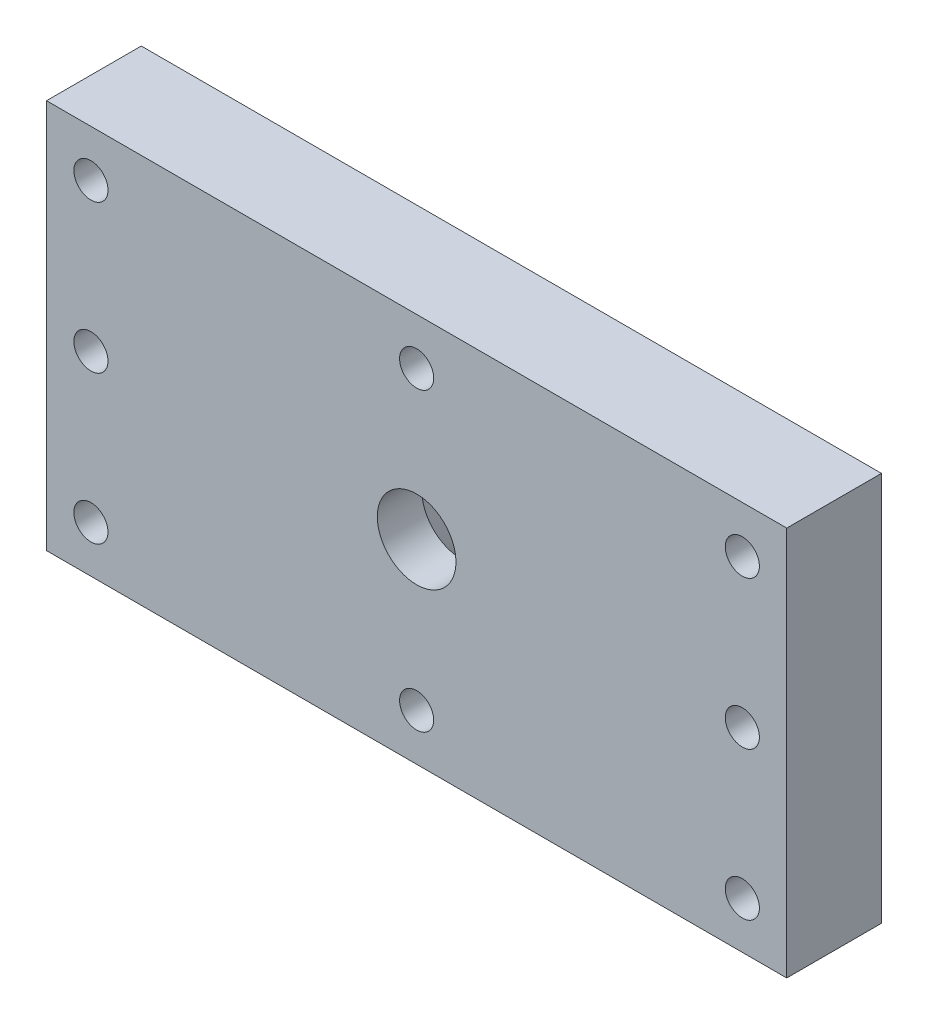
from build123d import *

# Parameters (mm, degrees)
SKETCH1_W             = 79.375
SKETCH1_H             = 41.783
BOSS_EXTRUDE1_DEPTH   = 10.16
F_6_CLEARANCE_HOLE1_D = 3.6576


with BuildPart() as part:
    # Sketch1 → Boss-Extrude1 (new body)
    with BuildSketch(Plane.XY):
        Rectangle(SKETCH1_W, SKETCH1_H)
    extrude(amount=BOSS_EXTRUDE1_DEPTH)

    # Sketch2 → CSK for 5_16 Flat Head Machine Screw1 (revolve, cut)
    with BuildSketch(Plane.YZ):
        Polygon((0, 0), (0, 10.16), (4.2164, 10.16), (4.2164, 5.376361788), (8.89, 0), align=None)
    revolve(axis=Axis((0, 0, -6.35), (0, 0, 1)), mode=Mode.SUBTRACT)

    # 6 Clearance Hole1 (through all)
    with Locations(Plane.XY.offset(10.16)):
        with Locations((-34.925, 15.875), (-34.925, 0), (-34.925, -15.875), (0, -15.875), (34.925, -15.875), (34.925, 0), (34.925, 15.875), (0, 15.875)):
            Hole(F_6_CLEARANCE_HOLE1_D / 2)


solid = part.part
